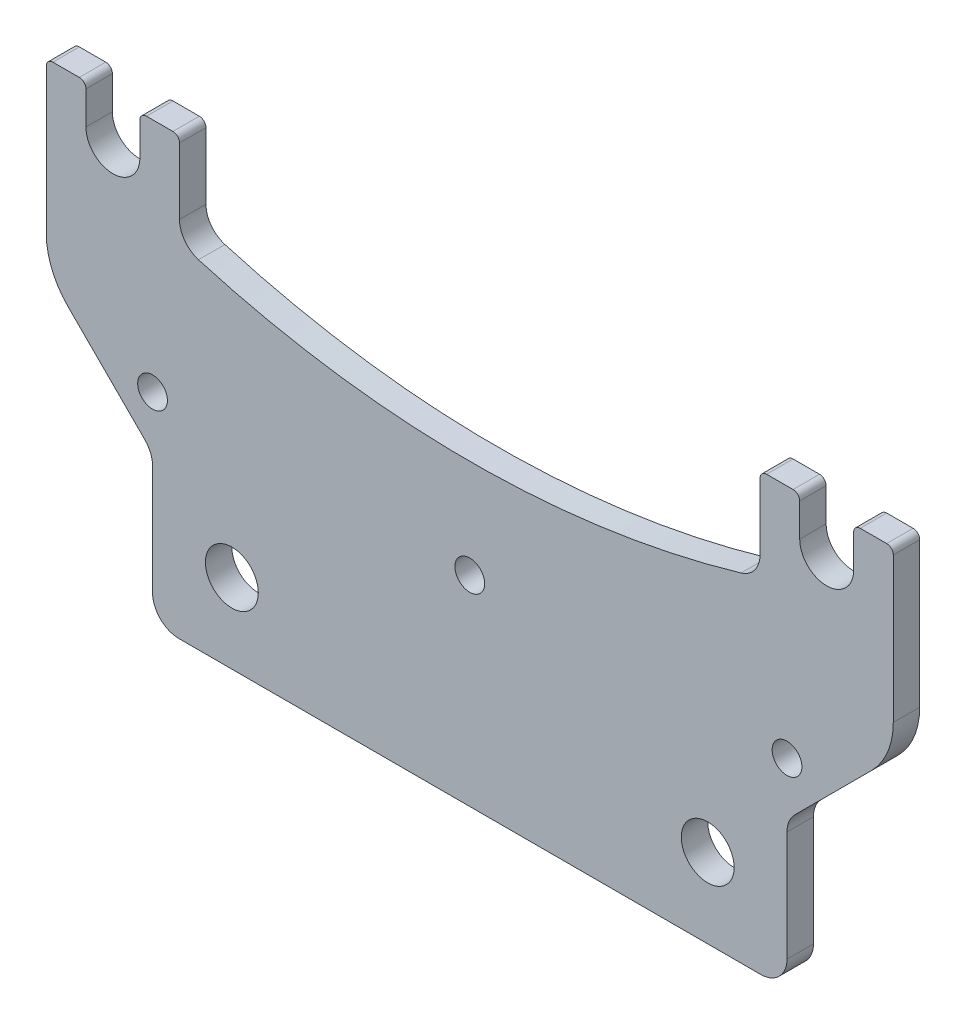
ISO-10303-21;
HEADER;
FILE_DESCRIPTION(('STEP AP214'),'2;1');
FILE_NAME('part.step','',(''),(''),'','','');
FILE_SCHEMA(('AUTOMOTIVE_DESIGN { 1 0 10303 214 1 1 1 1 }'));
ENDSEC;
DATA;
#1=APPLICATION_CONTEXT('core data for automotive mechanical design processes');
#2=APPLICATION_PROTOCOL_DEFINITION('international standard','automotive_design',2000,#1);
#3=PRODUCT_CONTEXT('',#1,'mechanical');
#4=PRODUCT('Part','Part','',(#3));
#5=PRODUCT_RELATED_PRODUCT_CATEGORY('part','',(#4));
#6=PRODUCT_DEFINITION_FORMATION('','',#4);
#7=PRODUCT_DEFINITION_CONTEXT('part definition',#1,'design');
#8=PRODUCT_DEFINITION('design','',#6,#7);
#9=PRODUCT_DEFINITION_SHAPE('','',#8);
#10=(LENGTH_UNIT() NAMED_UNIT(*) SI_UNIT(.MILLI.,.METRE.));
#11=(NAMED_UNIT(*) PLANE_ANGLE_UNIT() SI_UNIT($,.RADIAN.));
#12=(NAMED_UNIT(*) SI_UNIT($,.STERADIAN.) SOLID_ANGLE_UNIT());
#13=UNCERTAINTY_MEASURE_WITH_UNIT(LENGTH_MEASURE(1.E-05),#10,'distance_accuracy_value','');
#14=(GEOMETRIC_REPRESENTATION_CONTEXT(3) GLOBAL_UNCERTAINTY_ASSIGNED_CONTEXT((#13)) GLOBAL_UNIT_ASSIGNED_CONTEXT((#10,
#11,#12)) REPRESENTATION_CONTEXT('',''));
#15=CARTESIAN_POINT('',(0.,0.,0.));
#16=DIRECTION('',(0.,0.,1.));
#17=DIRECTION('',(1.,0.,0.));
#18=AXIS2_PLACEMENT_3D('',#15,#16,#17);
#19=CARTESIAN_POINT('',(85.725,207.94327164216,6.35));
#20=DIRECTION('',(0.,0.,1.));
#21=DIRECTION('',(1.,0.,0.));
#22=AXIS2_PLACEMENT_3D('',#19,#20,#21);
#23=PLANE('',#22);
#24=CARTESIAN_POINT('',(9.52499999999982,-47.1169999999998,6.35));
#25=DIRECTION('',(0.,0.,1.));
#26=DIRECTION('',(1.,0.,0.));
#27=AXIS2_PLACEMENT_3D('',#24,#25,#26);
#28=CIRCLE('',#27,3.57124);
#29=CARTESIAN_POINT('',(13.0962399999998,-47.1169999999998,6.35));
#30=VERTEX_POINT('',#29);
#31=EDGE_CURVE('E586',#30,#30,#28,.T.);
#32=ORIENTED_EDGE('',*,*,#31,.F.);
#33=EDGE_LOOP('',(#32));
#34=FACE_BOUND('',#33,.T.);
#35=CARTESIAN_POINT('',(85.725,-47.1169999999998,6.35));
#36=DIRECTION('',(0.,0.,1.));
#37=DIRECTION('',(1.,0.,0.));
#38=AXIS2_PLACEMENT_3D('',#35,#36,#37);
#39=CIRCLE('',#38,3.57124);
#40=CARTESIAN_POINT('',(89.29624,-47.1169999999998,6.35));
#41=VERTEX_POINT('',#40);
#42=EDGE_CURVE('E580',#41,#41,#39,.T.);
#43=ORIENTED_EDGE('',*,*,#42,.F.);
#44=EDGE_LOOP('',(#43));
#45=FACE_BOUND('',#44,.T.);
#46=CARTESIAN_POINT('',(161.925,-47.1169999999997,6.35));
#47=DIRECTION('',(0.,0.,1.));
#48=DIRECTION('',(1.,0.,0.));
#49=AXIS2_PLACEMENT_3D('',#46,#47,#48);
#50=CIRCLE('',#49,3.57124);
#51=CARTESIAN_POINT('',(165.49624,-47.1169999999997,6.35));
#52=VERTEX_POINT('',#51);
#53=EDGE_CURVE('E574',#52,#52,#50,.T.);
#54=ORIENTED_EDGE('',*,*,#53,.F.);
#55=EDGE_LOOP('',(#54));
#56=FACE_BOUND('',#55,.T.);
#57=DIRECTION('',(0.,1.,0.));
#58=VECTOR('',#57,1.);
#59=CARTESIAN_POINT('',(9.52499999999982,-95.25,6.35));
#60=LINE('',#59,#58);
#61=CARTESIAN_POINT('',(9.52499999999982,-88.9,6.35));
#62=VERTEX_POINT('',#61);
#63=CARTESIAN_POINT('',(9.5249999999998,-62.4472561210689,6.35));
#64=VERTEX_POINT('',#63);
#65=EDGE_CURVE('E555',#62,#64,#60,.T.);
#66=ORIENTED_EDGE('',*,*,#65,.F.);
#67=CARTESIAN_POINT('',(15.8749999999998,-88.9,6.35));
#68=DIRECTION('',(0.,0.,1.));
#69=DIRECTION('',(1.,0.,0.));
#70=AXIS2_PLACEMENT_3D('',#67,#68,#69);
#71=CIRCLE('',#70,6.35);
#72=CARTESIAN_POINT('',(15.8749999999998,-95.25,6.35));
#73=VERTEX_POINT('',#72);
#74=EDGE_CURVE('E480',#62,#73,#71,.T.);
#75=ORIENTED_EDGE('',*,*,#74,.T.);
#76=DIRECTION('',(1.,0.,0.));
#77=VECTOR('',#76,1.);
#78=CARTESIAN_POINT('',(9.52499999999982,-95.25,6.35));
#79=LINE('',#78,#77);
#80=CARTESIAN_POINT('',(155.575,-95.25,6.35));
#81=VERTEX_POINT('',#80);
#82=EDGE_CURVE('E305',#73,#81,#79,.T.);
#83=ORIENTED_EDGE('',*,*,#82,.T.);
#84=CARTESIAN_POINT('',(155.575,-88.9,6.35));
#85=DIRECTION('',(0.,0.,1.));
#86=DIRECTION('',(1.,0.,0.));
#87=AXIS2_PLACEMENT_3D('',#84,#85,#86);
#88=CIRCLE('',#87,6.35);
#89=CARTESIAN_POINT('',(161.925,-88.9,6.35));
#90=VERTEX_POINT('',#89);
#91=EDGE_CURVE('E55',#81,#90,#88,.T.);
#92=ORIENTED_EDGE('',*,*,#91,.T.);
#93=DIRECTION('',(0.,-1.,0.));
#94=VECTOR('',#93,1.);
#95=CARTESIAN_POINT('',(161.925,-95.2499999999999,6.35));
#96=LINE('',#95,#94);
#97=CARTESIAN_POINT('',(161.925,-62.4472561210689,6.35));
#98=VERTEX_POINT('',#97);
#99=EDGE_CURVE('E562',#98,#90,#96,.T.);
#100=ORIENTED_EDGE('',*,*,#99,.F.);
#101=CARTESIAN_POINT('',(168.275,-62.447256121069,6.35));
#102=DIRECTION('',(0.,0.,1.));
#103=DIRECTION('',(1.,0.,0.));
#104=AXIS2_PLACEMENT_3D('',#101,#102,#103);
#105=CIRCLE('',#104,6.35);
#106=CARTESIAN_POINT('',(163.784871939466,-57.9571280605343,6.35));
#107=VERTEX_POINT('',#106);
#108=EDGE_CURVE('E49',#98,#107,#105,.F.);
#109=ORIENTED_EDGE('',*,*,#108,.T.);
#110=DIRECTION('',(-0.707106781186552,-0.707106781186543,0.));
#111=VECTOR('',#110,1.);
#112=CARTESIAN_POINT('',(161.925,-59.8169999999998,6.35));
#113=LINE('',#112,#111);
#114=CARTESIAN_POINT('',(182.226198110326,-39.5158018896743,6.35));
#115=VERTEX_POINT('',#114);
#116=EDGE_CURVE('E565',#115,#107,#113,.T.);
#117=ORIENTED_EDGE('',*,*,#116,.F.);
#118=CARTESIAN_POINT('',(169.609996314,-26.8996000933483,6.35));
#119=DIRECTION('',(0.,0.,1.));
#120=DIRECTION('',(1.,0.,0.));
#121=AXIS2_PLACEMENT_3D('',#118,#119,#120);
#122=CIRCLE('',#121,17.842003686);
#123=CARTESIAN_POINT('',(187.452,-26.8996000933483,6.35));
#124=VERTEX_POINT('',#123);
#125=EDGE_CURVE('E379',#115,#124,#122,.T.);
#126=ORIENTED_EDGE('',*,*,#125,.T.);
#127=DIRECTION('',(0.,1.,0.));
#128=VECTOR('',#127,1.);
#129=CARTESIAN_POINT('',(187.452,4.7625,6.35));
#130=LINE('',#129,#128);
#131=CARTESIAN_POINT('',(187.452,7.93749999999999,6.35));
#132=VERTEX_POINT('',#131);
#133=EDGE_CURVE('E307',#124,#132,#130,.T.);
#134=ORIENTED_EDGE('',*,*,#133,.T.);
#135=CARTESIAN_POINT('',(185.8645,7.93749999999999,6.35));
#136=DIRECTION('',(0.,0.,1.));
#137=DIRECTION('',(1.,0.,0.));
#138=AXIS2_PLACEMENT_3D('',#135,#136,#137);
#139=CIRCLE('',#138,1.5875);
#140=CARTESIAN_POINT('',(185.8645,9.52499999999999,6.35));
#141=VERTEX_POINT('',#140);
#142=EDGE_CURVE('E431',#132,#141,#139,.T.);
#143=ORIENTED_EDGE('',*,*,#142,.T.);
#144=DIRECTION('',(-1.,0.,0.));
#145=VECTOR('',#144,1.);
#146=CARTESIAN_POINT('',(177.927,9.52499999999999,6.35));
#147=LINE('',#146,#145);
#148=CARTESIAN_POINT('',(179.5145,9.52499999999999,6.35));
#149=VERTEX_POINT('',#148);
#150=EDGE_CURVE('E310',#141,#149,#147,.T.);
#151=ORIENTED_EDGE('',*,*,#150,.T.);
#152=CARTESIAN_POINT('',(179.5145,7.93749999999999,6.35));
#153=DIRECTION('',(0.,0.,1.));
#154=DIRECTION('',(1.,0.,0.));
#155=AXIS2_PLACEMENT_3D('',#152,#153,#154);
#156=CIRCLE('',#155,1.5875);
#157=CARTESIAN_POINT('',(177.927,7.9375,6.35));
#158=VERTEX_POINT('',#157);
#159=EDGE_CURVE('E429',#149,#158,#156,.T.);
#160=ORIENTED_EDGE('',*,*,#159,.T.);
#161=DIRECTION('',(0.,-1.,0.));
#162=VECTOR('',#161,1.);
#163=CARTESIAN_POINT('',(177.927,4.7625,6.35));
#164=LINE('',#163,#162);
#165=CARTESIAN_POINT('',(177.927,0.,6.35));
#166=VERTEX_POINT('',#165);
#167=EDGE_CURVE('E313',#158,#166,#164,.T.);
#168=ORIENTED_EDGE('',*,*,#167,.T.);
#169=CARTESIAN_POINT('',(171.45,0.,6.35));
#170=DIRECTION('',(0.,0.,-1.));
#171=DIRECTION('',(-1.,0.,0.));
#172=AXIS2_PLACEMENT_3D('',#169,#170,#171);
#173=CIRCLE('',#172,6.47699999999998);
#174=CARTESIAN_POINT('',(164.973,0.,6.35));
#175=VERTEX_POINT('',#174);
#176=EDGE_CURVE('E315',#166,#175,#173,.T.);
#177=ORIENTED_EDGE('',*,*,#176,.T.);
#178=DIRECTION('',(0.,1.,0.));
#179=VECTOR('',#178,1.);
#180=CARTESIAN_POINT('',(164.973,0.,6.35));
#181=LINE('',#180,#179);
#182=CARTESIAN_POINT('',(164.973,7.93749999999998,6.35));
#183=VERTEX_POINT('',#182);
#184=EDGE_CURVE('E317',#175,#183,#181,.T.);
#185=ORIENTED_EDGE('',*,*,#184,.T.);
#186=CARTESIAN_POINT('',(163.3855,7.93749999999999,6.35));
#187=DIRECTION('',(0.,0.,1.));
#188=DIRECTION('',(1.,0.,0.));
#189=AXIS2_PLACEMENT_3D('',#186,#187,#188);
#190=CIRCLE('',#189,1.5875);
#191=CARTESIAN_POINT('',(163.3855,9.52499999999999,6.35));
#192=VERTEX_POINT('',#191);
#193=EDGE_CURVE('E427',#183,#192,#190,.T.);
#194=ORIENTED_EDGE('',*,*,#193,.T.);
#195=DIRECTION('',(-1.,0.,0.));
#196=VECTOR('',#195,1.);
#197=CARTESIAN_POINT('',(164.973,9.52499999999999,6.35));
#198=LINE('',#197,#196);
#199=CARTESIAN_POINT('',(157.0355,9.52499999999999,6.35));
#200=VERTEX_POINT('',#199);
#201=EDGE_CURVE('E320',#192,#200,#198,.T.);
#202=ORIENTED_EDGE('',*,*,#201,.T.);
#203=CARTESIAN_POINT('',(157.0355,7.93749999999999,6.35));
#204=DIRECTION('',(0.,0.,1.));
#205=DIRECTION('',(1.,0.,0.));
#206=AXIS2_PLACEMENT_3D('',#203,#204,#205);
#207=CIRCLE('',#206,1.5875);
#208=CARTESIAN_POINT('',(155.448,7.93749999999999,6.35));
#209=VERTEX_POINT('',#208);
#210=EDGE_CURVE('E425',#200,#209,#207,.T.);
#211=ORIENTED_EDGE('',*,*,#210,.T.);
#212=DIRECTION('',(0.,-1.,0.));
#213=VECTOR('',#212,1.);
#214=CARTESIAN_POINT('',(155.448,4.76249999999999,6.35));
#215=LINE('',#214,#213);
#216=CARTESIAN_POINT('',(155.448,-7.99697153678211,6.35));
#217=VERTEX_POINT('',#216);
#218=EDGE_CURVE('E367',#209,#217,#215,.T.);
#219=ORIENTED_EDGE('',*,*,#218,.T.);
#220=CARTESIAN_POINT('',(149.098,-7.99697153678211,6.35));
#221=DIRECTION('',(0.,0.,1.));
#222=DIRECTION('',(1.,0.,0.));
#223=AXIS2_PLACEMENT_3D('',#220,#221,#222);
#224=CIRCLE('',#223,6.35);
#225=CARTESIAN_POINT('',(150.886150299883,-14.0900018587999,6.35));
#226=VERTEX_POINT('',#225);
#227=EDGE_CURVE('E512',#217,#226,#224,.F.);
#228=ORIENTED_EDGE('',*,*,#227,.T.);
#229=CARTESIAN_POINT('',(85.725,207.94327164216,6.35));
#230=DIRECTION('',(0.,0.,-1.));
#231=DIRECTION('',(1.,0.,0.));
#232=AXIS2_PLACEMENT_3D('',#229,#230,#231);
#233=CIRCLE('',#232,231.397385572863);
#234=CARTESIAN_POINT('',(20.5638497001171,-14.0900018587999,6.35));
#235=VERTEX_POINT('',#234);
#236=EDGE_CURVE('E530',#226,#235,#233,.T.);
#237=ORIENTED_EDGE('',*,*,#236,.T.);
#238=CARTESIAN_POINT('',(22.352,-7.99697153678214,6.35));
#239=DIRECTION('',(0.,0.,1.));
#240=DIRECTION('',(1.,0.,0.));
#241=AXIS2_PLACEMENT_3D('',#238,#239,#240);
#242=CIRCLE('',#241,6.35);
#243=CARTESIAN_POINT('',(16.002,-7.99697153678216,6.35));
#244=VERTEX_POINT('',#243);
#245=EDGE_CURVE('E11',#235,#244,#242,.F.);
#246=ORIENTED_EDGE('',*,*,#245,.T.);
#247=DIRECTION('',(0.,1.,0.));
#248=VECTOR('',#247,1.);
#249=CARTESIAN_POINT('',(16.002,0.,6.35));
#250=LINE('',#249,#248);
#251=CARTESIAN_POINT('',(16.002,7.93749999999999,6.35));
#252=VERTEX_POINT('',#251);
#253=EDGE_CURVE('E529',#244,#252,#250,.T.);
#254=ORIENTED_EDGE('',*,*,#253,.T.);
#255=CARTESIAN_POINT('',(14.4145,7.93749999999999,6.35));
#256=DIRECTION('',(0.,0.,1.));
#257=DIRECTION('',(1.,0.,0.));
#258=AXIS2_PLACEMENT_3D('',#255,#256,#257);
#259=CIRCLE('',#258,1.5875);
#260=CARTESIAN_POINT('',(14.4145,9.52499999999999,6.35));
#261=VERTEX_POINT('',#260);
#262=EDGE_CURVE('E421',#252,#261,#259,.T.);
#263=ORIENTED_EDGE('',*,*,#262,.T.);
#264=DIRECTION('',(-1.,0.,0.));
#265=VECTOR('',#264,1.);
#266=CARTESIAN_POINT('',(6.47699999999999,9.52499999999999,6.35));
#267=LINE('',#266,#265);
#268=CARTESIAN_POINT('',(8.06449999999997,9.52499999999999,6.35));
#269=VERTEX_POINT('',#268);
#270=EDGE_CURVE('E279',#261,#269,#267,.T.);
#271=ORIENTED_EDGE('',*,*,#270,.T.);
#272=CARTESIAN_POINT('',(8.06449999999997,7.93749999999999,6.35));
#273=DIRECTION('',(0.,0.,1.));
#274=DIRECTION('',(1.,0.,0.));
#275=AXIS2_PLACEMENT_3D('',#272,#273,#274);
#276=CIRCLE('',#275,1.5875);
#277=CARTESIAN_POINT('',(6.47699999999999,7.93749999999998,6.35));
#278=VERTEX_POINT('',#277);
#279=EDGE_CURVE('E275',#269,#278,#276,.T.);
#280=ORIENTED_EDGE('',*,*,#279,.T.);
#281=DIRECTION('',(0.,-1.,0.));
#282=VECTOR('',#281,1.);
#283=CARTESIAN_POINT('',(6.47699999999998,4.7625,6.35));
#284=LINE('',#283,#282);
#285=CARTESIAN_POINT('',(6.477,0.,6.35));
#286=VERTEX_POINT('',#285);
#287=EDGE_CURVE('E265',#278,#286,#284,.T.);
#288=ORIENTED_EDGE('',*,*,#287,.T.);
#289=CARTESIAN_POINT('',(0.,0.,6.35));
#290=DIRECTION('',(0.,0.,-1.));
#291=DIRECTION('',(1.,0.,0.));
#292=AXIS2_PLACEMENT_3D('',#289,#290,#291);
#293=CIRCLE('',#292,6.477);
#294=CARTESIAN_POINT('',(-6.477,0.,6.35));
#295=VERTEX_POINT('',#294);
#296=EDGE_CURVE('E271',#286,#295,#293,.T.);
#297=ORIENTED_EDGE('',*,*,#296,.T.);
#298=DIRECTION('',(0.,1.,0.));
#299=VECTOR('',#298,1.);
#300=CARTESIAN_POINT('',(-6.477,0.,6.35));
#301=LINE('',#300,#299);
#302=CARTESIAN_POINT('',(-6.47699999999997,7.93749999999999,6.35));
#303=VERTEX_POINT('',#302);
#304=EDGE_CURVE('E295',#295,#303,#301,.T.);
#305=ORIENTED_EDGE('',*,*,#304,.T.);
#306=CARTESIAN_POINT('',(-8.0645,7.93749999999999,6.35));
#307=DIRECTION('',(0.,0.,1.));
#308=DIRECTION('',(1.,0.,0.));
#309=AXIS2_PLACEMENT_3D('',#306,#307,#308);
#310=CIRCLE('',#309,1.5875);
#311=CARTESIAN_POINT('',(-8.0645,9.52499999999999,6.35));
#312=VERTEX_POINT('',#311);
#313=EDGE_CURVE('E418',#303,#312,#310,.T.);
#314=ORIENTED_EDGE('',*,*,#313,.T.);
#315=DIRECTION('',(-1.,0.,0.));
#316=VECTOR('',#315,1.);
#317=CARTESIAN_POINT('',(-6.477,9.52499999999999,6.35));
#318=LINE('',#317,#316);
#319=CARTESIAN_POINT('',(-14.4145,9.52499999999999,6.35));
#320=VERTEX_POINT('',#319);
#321=EDGE_CURVE('E297',#312,#320,#318,.T.);
#322=ORIENTED_EDGE('',*,*,#321,.T.);
#323=CARTESIAN_POINT('',(-14.4145,7.93749999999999,6.35));
#324=DIRECTION('',(0.,0.,1.));
#325=DIRECTION('',(1.,0.,0.));
#326=AXIS2_PLACEMENT_3D('',#323,#324,#325);
#327=CIRCLE('',#326,1.5875);
#328=CARTESIAN_POINT('',(-16.002,7.93749999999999,6.35));
#329=VERTEX_POINT('',#328);
#330=EDGE_CURVE('E423',#320,#329,#327,.T.);
#331=ORIENTED_EDGE('',*,*,#330,.T.);
#332=DIRECTION('',(0.,-1.,0.));
#333=VECTOR('',#332,1.);
#334=CARTESIAN_POINT('',(-16.002,9.52499999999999,6.35));
#335=LINE('',#334,#333);
#336=CARTESIAN_POINT('',(-16.002,-26.899600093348,6.35));
#337=VERTEX_POINT('',#336);
#338=EDGE_CURVE('E303',#329,#337,#335,.T.);
#339=ORIENTED_EDGE('',*,*,#338,.T.);
#340=CARTESIAN_POINT('',(1.840003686,-26.899600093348,6.35));
#341=DIRECTION('',(0.,0.,1.));
#342=DIRECTION('',(1.,0.,0.));
#343=AXIS2_PLACEMENT_3D('',#340,#341,#342);
#344=CIRCLE('',#343,17.842003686);
#345=CARTESIAN_POINT('',(-10.776198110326,-39.515801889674,6.35));
#346=VERTEX_POINT('',#345);
#347=EDGE_CURVE('E376',#337,#346,#344,.T.);
#348=ORIENTED_EDGE('',*,*,#347,.T.);
#349=DIRECTION('',(-0.707106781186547,0.707106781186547,0.));
#350=VECTOR('',#349,1.);
#351=CARTESIAN_POINT('',(9.5249999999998,-59.8169999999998,6.35));
#352=LINE('',#351,#350);
#353=CARTESIAN_POINT('',(7.66512806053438,-57.9571280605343,6.35));
#354=VERTEX_POINT('',#353);
#355=EDGE_CURVE('E552',#354,#346,#352,.T.);
#356=ORIENTED_EDGE('',*,*,#355,.F.);
#357=CARTESIAN_POINT('',(3.1749999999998,-62.4472561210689,6.35));
#358=DIRECTION('',(0.,0.,1.));
#359=DIRECTION('',(1.,0.,0.));
#360=AXIS2_PLACEMENT_3D('',#357,#358,#359);
#361=CIRCLE('',#360,6.35);
#362=EDGE_CURVE('E503',#354,#64,#361,.F.);
#363=ORIENTED_EDGE('',*,*,#362,.T.);
#364=EDGE_LOOP('',(#66,#75,#83,#92,#100,#109,#117,#126,#134,#143,#151,#160,#168,#177,#185,#194,
#202,#211,#219,#228,#237,#246,#254,#263,#271,#280,#288,#297,#305,#314,#322,#331,#339,#348,#356,#363));
#365=FACE_BOUND('',#364,.T.);
#366=CARTESIAN_POINT('',(28.575,-76.2,6.35));
#367=DIRECTION('',(0.,0.,1.));
#368=DIRECTION('',(1.,0.,0.));
#369=AXIS2_PLACEMENT_3D('',#366,#367,#368);
#370=CIRCLE('',#369,6.35);
#371=CARTESIAN_POINT('',(34.925,-76.2,6.35));
#372=VERTEX_POINT('',#371);
#373=EDGE_CURVE('E328',#372,#372,#370,.T.);
#374=ORIENTED_EDGE('',*,*,#373,.F.);
#375=EDGE_LOOP('',(#374));
#376=FACE_BOUND('',#375,.T.);
#377=CARTESIAN_POINT('',(142.875,-76.2,6.35));
#378=DIRECTION('',(0.,0.,1.));
#379=DIRECTION('',(-1.,0.,0.));
#380=AXIS2_PLACEMENT_3D('',#377,#378,#379);
#381=CIRCLE('',#380,6.35000000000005);
#382=CARTESIAN_POINT('',(136.525,-76.2,6.35));
#383=VERTEX_POINT('',#382);
#384=EDGE_CURVE('E543',#383,#383,#381,.T.);
#385=ORIENTED_EDGE('',*,*,#384,.F.);
#386=EDGE_LOOP('',(#385));
#387=FACE_BOUND('',#386,.T.);
#388=ADVANCED_FACE('F34',(#34,#45,#56,#365,#376,#387),#23,.T.);
#389=CARTESIAN_POINT('',(85.725,207.94327164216,0.));
#390=DIRECTION('',(0.,0.,1.));
#391=DIRECTION('',(1.,0.,0.));
#392=AXIS2_PLACEMENT_3D('',#389,#390,#391);
#393=PLANE('',#392);
#394=CARTESIAN_POINT('',(9.52499999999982,-47.1169999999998,0.));
#395=DIRECTION('',(0.,0.,1.));
#396=DIRECTION('',(1.,0.,0.));
#397=AXIS2_PLACEMENT_3D('',#394,#395,#396);
#398=CIRCLE('',#397,3.57124);
#399=CARTESIAN_POINT('',(13.0962399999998,-47.1169999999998,0.));
#400=VERTEX_POINT('',#399);
#401=EDGE_CURVE('E583',#400,#400,#398,.T.);
#402=ORIENTED_EDGE('',*,*,#401,.T.);
#403=EDGE_LOOP('',(#402));
#404=FACE_BOUND('',#403,.T.);
#405=CARTESIAN_POINT('',(85.725,-47.1169999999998,0.));
#406=DIRECTION('',(0.,0.,1.));
#407=DIRECTION('',(1.,0.,0.));
#408=AXIS2_PLACEMENT_3D('',#405,#406,#407);
#409=CIRCLE('',#408,3.57124);
#410=CARTESIAN_POINT('',(89.29624,-47.1169999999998,0.));
#411=VERTEX_POINT('',#410);
#412=EDGE_CURVE('E577',#411,#411,#409,.T.);
#413=ORIENTED_EDGE('',*,*,#412,.T.);
#414=EDGE_LOOP('',(#413));
#415=FACE_BOUND('',#414,.T.);
#416=CARTESIAN_POINT('',(161.925,-47.1169999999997,0.));
#417=DIRECTION('',(0.,0.,1.));
#418=DIRECTION('',(1.,0.,0.));
#419=AXIS2_PLACEMENT_3D('',#416,#417,#418);
#420=CIRCLE('',#419,3.57124);
#421=CARTESIAN_POINT('',(165.49624,-47.1169999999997,0.));
#422=VERTEX_POINT('',#421);
#423=EDGE_CURVE('E567',#422,#422,#420,.T.);
#424=ORIENTED_EDGE('',*,*,#423,.T.);
#425=EDGE_LOOP('',(#424));
#426=FACE_BOUND('',#425,.T.);
#427=DIRECTION('',(1.,0.,0.));
#428=VECTOR('',#427,1.);
#429=CARTESIAN_POINT('',(9.52499999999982,-95.25,0.));
#430=LINE('',#429,#428);
#431=CARTESIAN_POINT('',(15.8749999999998,-95.25,0.));
#432=VERTEX_POINT('',#431);
#433=CARTESIAN_POINT('',(155.575,-95.25,0.));
#434=VERTEX_POINT('',#433);
#435=EDGE_CURVE('E344',#432,#434,#430,.T.);
#436=ORIENTED_EDGE('',*,*,#435,.F.);
#437=CARTESIAN_POINT('',(15.8749999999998,-88.9,0.));
#438=DIRECTION('',(0.,0.,1.));
#439=DIRECTION('',(1.,0.,0.));
#440=AXIS2_PLACEMENT_3D('',#437,#438,#439);
#441=CIRCLE('',#440,6.35);
#442=CARTESIAN_POINT('',(9.52499999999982,-88.9,0.));
#443=VERTEX_POINT('',#442);
#444=EDGE_CURVE('E473',#432,#443,#441,.F.);
#445=ORIENTED_EDGE('',*,*,#444,.T.);
#446=DIRECTION('',(0.,1.,0.));
#447=VECTOR('',#446,1.);
#448=CARTESIAN_POINT('',(9.52499999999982,-95.25,0.));
#449=LINE('',#448,#447);
#450=CARTESIAN_POINT('',(9.5249999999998,-62.4472561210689,0.));
#451=VERTEX_POINT('',#450);
#452=EDGE_CURVE('E554',#443,#451,#449,.T.);
#453=ORIENTED_EDGE('',*,*,#452,.T.);
#454=CARTESIAN_POINT('',(3.1749999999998,-62.4472561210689,0.));
#455=DIRECTION('',(0.,0.,1.));
#456=DIRECTION('',(1.,0.,0.));
#457=AXIS2_PLACEMENT_3D('',#454,#455,#456);
#458=CIRCLE('',#457,6.35);
#459=CARTESIAN_POINT('',(7.66512806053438,-57.9571280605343,0.));
#460=VERTEX_POINT('',#459);
#461=EDGE_CURVE('E505',#451,#460,#458,.T.);
#462=ORIENTED_EDGE('',*,*,#461,.T.);
#463=DIRECTION('',(-0.707106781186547,0.707106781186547,0.));
#464=VECTOR('',#463,1.);
#465=CARTESIAN_POINT('',(9.5249999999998,-59.8169999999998,0.));
#466=LINE('',#465,#464);
#467=CARTESIAN_POINT('',(-10.776198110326,-39.515801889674,0.));
#468=VERTEX_POINT('',#467);
#469=EDGE_CURVE('E549',#460,#468,#466,.T.);
#470=ORIENTED_EDGE('',*,*,#469,.T.);
#471=CARTESIAN_POINT('',(1.840003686,-26.899600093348,0.));
#472=DIRECTION('',(0.,0.,1.));
#473=DIRECTION('',(1.,0.,0.));
#474=AXIS2_PLACEMENT_3D('',#471,#472,#473);
#475=CIRCLE('',#474,17.842003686);
#476=CARTESIAN_POINT('',(-16.002,-26.899600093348,0.));
#477=VERTEX_POINT('',#476);
#478=EDGE_CURVE('E383',#468,#477,#475,.F.);
#479=ORIENTED_EDGE('',*,*,#478,.T.);
#480=DIRECTION('',(0.,-1.,0.));
#481=VECTOR('',#480,1.);
#482=CARTESIAN_POINT('',(-16.002,4.7625,0.));
#483=LINE('',#482,#481);
#484=CARTESIAN_POINT('',(-16.002,7.93749999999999,0.));
#485=VERTEX_POINT('',#484);
#486=EDGE_CURVE('E342',#485,#477,#483,.T.);
#487=ORIENTED_EDGE('',*,*,#486,.F.);
#488=CARTESIAN_POINT('',(-14.4145,7.93749999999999,0.));
#489=DIRECTION('',(0.,0.,1.));
#490=DIRECTION('',(1.,0.,0.));
#491=AXIS2_PLACEMENT_3D('',#488,#489,#490);
#492=CIRCLE('',#491,1.5875);
#493=CARTESIAN_POINT('',(-14.4145,9.52499999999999,0.));
#494=VERTEX_POINT('',#493);
#495=EDGE_CURVE('E406',#485,#494,#492,.F.);
#496=ORIENTED_EDGE('',*,*,#495,.T.);
#497=DIRECTION('',(-1.,0.,0.));
#498=VECTOR('',#497,1.);
#499=CARTESIAN_POINT('',(-6.477,9.52499999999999,0.));
#500=LINE('',#499,#498);
#501=CARTESIAN_POINT('',(-8.0645,9.52499999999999,0.));
#502=VERTEX_POINT('',#501);
#503=EDGE_CURVE('E339',#502,#494,#500,.T.);
#504=ORIENTED_EDGE('',*,*,#503,.F.);
#505=CARTESIAN_POINT('',(-8.0645,7.93749999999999,0.));
#506=DIRECTION('',(0.,0.,1.));
#507=DIRECTION('',(1.,0.,0.));
#508=AXIS2_PLACEMENT_3D('',#505,#506,#507);
#509=CIRCLE('',#508,1.5875);
#510=CARTESIAN_POINT('',(-6.47699999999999,7.9375,0.));
#511=VERTEX_POINT('',#510);
#512=EDGE_CURVE('E399',#502,#511,#509,.F.);
#513=ORIENTED_EDGE('',*,*,#512,.T.);
#514=DIRECTION('',(0.,1.,0.));
#515=VECTOR('',#514,1.);
#516=CARTESIAN_POINT('',(-6.47699999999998,4.7625,0.));
#517=LINE('',#516,#515);
#518=CARTESIAN_POINT('',(-6.477,0.,0.));
#519=VERTEX_POINT('',#518);
#520=EDGE_CURVE('E336',#519,#511,#517,.T.);
#521=ORIENTED_EDGE('',*,*,#520,.F.);
#522=CARTESIAN_POINT('',(0.,0.,0.));
#523=DIRECTION('',(0.,0.,-1.));
#524=DIRECTION('',(1.,0.,0.));
#525=AXIS2_PLACEMENT_3D('',#522,#523,#524);
#526=CIRCLE('',#525,6.477);
#527=CARTESIAN_POINT('',(6.477,0.,0.));
#528=VERTEX_POINT('',#527);
#529=EDGE_CURVE('E334',#528,#519,#526,.T.);
#530=ORIENTED_EDGE('',*,*,#529,.F.);
#531=DIRECTION('',(0.,-1.,0.));
#532=VECTOR('',#531,1.);
#533=CARTESIAN_POINT('',(6.477,0.,0.));
#534=LINE('',#533,#532);
#535=CARTESIAN_POINT('',(6.47699999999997,7.93749999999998,0.));
#536=VERTEX_POINT('',#535);
#537=EDGE_CURVE('E285',#536,#528,#534,.T.);
#538=ORIENTED_EDGE('',*,*,#537,.F.);
#539=CARTESIAN_POINT('',(8.06449999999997,7.93749999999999,0.));
#540=DIRECTION('',(0.,0.,1.));
#541=DIRECTION('',(1.,0.,0.));
#542=AXIS2_PLACEMENT_3D('',#539,#540,#541);
#543=CIRCLE('',#542,1.5875);
#544=CARTESIAN_POINT('',(8.06449999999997,9.52499999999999,0.));
#545=VERTEX_POINT('',#544);
#546=EDGE_CURVE('E401',#536,#545,#543,.F.);
#547=ORIENTED_EDGE('',*,*,#546,.T.);
#548=DIRECTION('',(-1.,0.,0.));
#549=VECTOR('',#548,1.);
#550=CARTESIAN_POINT('',(6.47699999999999,9.52499999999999,0.));
#551=LINE('',#550,#549);
#552=CARTESIAN_POINT('',(14.4145,9.52499999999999,0.));
#553=VERTEX_POINT('',#552);
#554=EDGE_CURVE('E330',#553,#545,#551,.T.);
#555=ORIENTED_EDGE('',*,*,#554,.F.);
#556=CARTESIAN_POINT('',(14.4145,7.93749999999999,0.));
#557=DIRECTION('',(0.,0.,1.));
#558=DIRECTION('',(1.,0.,0.));
#559=AXIS2_PLACEMENT_3D('',#556,#557,#558);
#560=CIRCLE('',#559,1.5875);
#561=CARTESIAN_POINT('',(16.002,7.93749999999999,0.));
#562=VERTEX_POINT('',#561);
#563=EDGE_CURVE('E403',#553,#562,#560,.F.);
#564=ORIENTED_EDGE('',*,*,#563,.T.);
#565=DIRECTION('',(0.,1.,0.));
#566=VECTOR('',#565,1.);
#567=CARTESIAN_POINT('',(16.002,9.52499999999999,0.));
#568=LINE('',#567,#566);
#569=CARTESIAN_POINT('',(16.0020000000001,-7.99697153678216,0.));
#570=VERTEX_POINT('',#569);
#571=EDGE_CURVE('E327',#570,#562,#568,.T.);
#572=ORIENTED_EDGE('',*,*,#571,.F.);
#573=CARTESIAN_POINT('',(22.352,-7.99697153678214,0.));
#574=DIRECTION('',(0.,0.,1.));
#575=DIRECTION('',(1.,0.,0.));
#576=AXIS2_PLACEMENT_3D('',#573,#574,#575);
#577=CIRCLE('',#576,6.35);
#578=CARTESIAN_POINT('',(20.5638497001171,-14.0900018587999,0.));
#579=VERTEX_POINT('',#578);
#580=EDGE_CURVE('E42',#570,#579,#577,.T.);
#581=ORIENTED_EDGE('',*,*,#580,.T.);
#582=CARTESIAN_POINT('',(85.725,207.94327164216,0.));
#583=DIRECTION('',(0.,0.,-1.));
#584=DIRECTION('',(1.,0.,0.));
#585=AXIS2_PLACEMENT_3D('',#582,#583,#584);
#586=CIRCLE('',#585,231.397385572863);
#587=CARTESIAN_POINT('',(150.886150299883,-14.0900018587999,0.));
#588=VERTEX_POINT('',#587);
#589=EDGE_CURVE('E324',#588,#579,#586,.T.);
#590=ORIENTED_EDGE('',*,*,#589,.F.);
#591=CARTESIAN_POINT('',(149.098,-7.99697153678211,0.));
#592=DIRECTION('',(0.,0.,1.));
#593=DIRECTION('',(1.,0.,0.));
#594=AXIS2_PLACEMENT_3D('',#591,#592,#593);
#595=CIRCLE('',#594,6.35);
#596=CARTESIAN_POINT('',(155.448,-7.99697153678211,0.));
#597=VERTEX_POINT('',#596);
#598=EDGE_CURVE('E510',#588,#597,#595,.T.);
#599=ORIENTED_EDGE('',*,*,#598,.T.);
#600=DIRECTION('',(0.,-1.,0.));
#601=VECTOR('',#600,1.);
#602=CARTESIAN_POINT('',(155.448,9.52499999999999,0.));
#603=LINE('',#602,#601);
#604=CARTESIAN_POINT('',(155.448,7.93749999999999,0.));
#605=VERTEX_POINT('',#604);
#606=EDGE_CURVE('E364',#605,#597,#603,.T.);
#607=ORIENTED_EDGE('',*,*,#606,.F.);
#608=CARTESIAN_POINT('',(157.0355,7.93749999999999,0.));
#609=DIRECTION('',(0.,0.,1.));
#610=DIRECTION('',(1.,0.,0.));
#611=AXIS2_PLACEMENT_3D('',#608,#609,#610);
#612=CIRCLE('',#611,1.5875);
#613=CARTESIAN_POINT('',(157.0355,9.52499999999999,0.));
#614=VERTEX_POINT('',#613);
#615=EDGE_CURVE('E408',#605,#614,#612,.F.);
#616=ORIENTED_EDGE('',*,*,#615,.T.);
#617=DIRECTION('',(-1.,0.,0.));
#618=VECTOR('',#617,1.);
#619=CARTESIAN_POINT('',(164.973,9.52499999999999,0.));
#620=LINE('',#619,#618);
#621=CARTESIAN_POINT('',(163.3855,9.52499999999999,0.));
#622=VERTEX_POINT('',#621);
#623=EDGE_CURVE('E361',#622,#614,#620,.T.);
#624=ORIENTED_EDGE('',*,*,#623,.F.);
#625=CARTESIAN_POINT('',(163.3855,7.93749999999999,0.));
#626=DIRECTION('',(0.,0.,1.));
#627=DIRECTION('',(1.,0.,0.));
#628=AXIS2_PLACEMENT_3D('',#625,#626,#627);
#629=CIRCLE('',#628,1.5875);
#630=CARTESIAN_POINT('',(164.973,7.93749999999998,0.));
#631=VERTEX_POINT('',#630);
#632=EDGE_CURVE('E410',#622,#631,#629,.F.);
#633=ORIENTED_EDGE('',*,*,#632,.T.);
#634=DIRECTION('',(0.,1.,0.));
#635=VECTOR('',#634,1.);
#636=CARTESIAN_POINT('',(164.973,4.76249999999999,0.));
#637=LINE('',#636,#635);
#638=CARTESIAN_POINT('',(164.973,0.,0.));
#639=VERTEX_POINT('',#638);
#640=EDGE_CURVE('E358',#639,#631,#637,.T.);
#641=ORIENTED_EDGE('',*,*,#640,.F.);
#642=CARTESIAN_POINT('',(171.45,0.,0.));
#643=DIRECTION('',(0.,0.,-1.));
#644=DIRECTION('',(-1.,0.,0.));
#645=AXIS2_PLACEMENT_3D('',#642,#643,#644);
#646=CIRCLE('',#645,6.47699999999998);
#647=CARTESIAN_POINT('',(177.927,0.,0.));
#648=VERTEX_POINT('',#647);
#649=EDGE_CURVE('E355',#648,#639,#646,.T.);
#650=ORIENTED_EDGE('',*,*,#649,.F.);
#651=DIRECTION('',(0.,-1.,0.));
#652=VECTOR('',#651,1.);
#653=CARTESIAN_POINT('',(177.927,0.,0.));
#654=LINE('',#653,#652);
#655=CARTESIAN_POINT('',(177.927,7.9375,0.));
#656=VERTEX_POINT('',#655);
#657=EDGE_CURVE('E353',#656,#648,#654,.T.);
#658=ORIENTED_EDGE('',*,*,#657,.F.);
#659=CARTESIAN_POINT('',(179.5145,7.93749999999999,0.));
#660=DIRECTION('',(0.,0.,1.));
#661=DIRECTION('',(1.,0.,0.));
#662=AXIS2_PLACEMENT_3D('',#659,#660,#661);
#663=CIRCLE('',#662,1.5875);
#664=CARTESIAN_POINT('',(179.5145,9.52499999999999,0.));
#665=VERTEX_POINT('',#664);
#666=EDGE_CURVE('E412',#656,#665,#663,.F.);
#667=ORIENTED_EDGE('',*,*,#666,.T.);
#668=DIRECTION('',(-1.,0.,0.));
#669=VECTOR('',#668,1.);
#670=CARTESIAN_POINT('',(177.927,9.52499999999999,0.));
#671=LINE('',#670,#669);
#672=CARTESIAN_POINT('',(185.8645,9.52499999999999,0.));
#673=VERTEX_POINT('',#672);
#674=EDGE_CURVE('E350',#673,#665,#671,.T.);
#675=ORIENTED_EDGE('',*,*,#674,.F.);
#676=CARTESIAN_POINT('',(185.8645,7.93749999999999,0.));
#677=DIRECTION('',(0.,0.,1.));
#678=DIRECTION('',(1.,0.,0.));
#679=AXIS2_PLACEMENT_3D('',#676,#677,#678);
#680=CIRCLE('',#679,1.5875);
#681=CARTESIAN_POINT('',(187.452,7.93749999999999,0.));
#682=VERTEX_POINT('',#681);
#683=EDGE_CURVE('E414',#673,#682,#680,.F.);
#684=ORIENTED_EDGE('',*,*,#683,.T.);
#685=DIRECTION('',(0.,1.,0.));
#686=VECTOR('',#685,1.);
#687=CARTESIAN_POINT('',(187.452,9.52499999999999,0.));
#688=LINE('',#687,#686);
#689=CARTESIAN_POINT('',(187.452,-26.8996000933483,0.));
#690=VERTEX_POINT('',#689);
#691=EDGE_CURVE('E347',#690,#682,#688,.T.);
#692=ORIENTED_EDGE('',*,*,#691,.F.);
#693=CARTESIAN_POINT('',(169.609996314,-26.8996000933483,0.));
#694=DIRECTION('',(0.,0.,1.));
#695=DIRECTION('',(1.,0.,0.));
#696=AXIS2_PLACEMENT_3D('',#693,#694,#695);
#697=CIRCLE('',#696,17.842003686);
#698=CARTESIAN_POINT('',(182.226198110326,-39.5158018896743,0.));
#699=VERTEX_POINT('',#698);
#700=EDGE_CURVE('E386',#690,#699,#697,.F.);
#701=ORIENTED_EDGE('',*,*,#700,.T.);
#702=DIRECTION('',(-0.707106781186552,-0.707106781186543,0.));
#703=VECTOR('',#702,1.);
#704=CARTESIAN_POINT('',(161.925,-59.8169999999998,0.));
#705=LINE('',#704,#703);
#706=CARTESIAN_POINT('',(163.784871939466,-57.9571280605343,0.));
#707=VERTEX_POINT('',#706);
#708=EDGE_CURVE('E564',#699,#707,#705,.T.);
#709=ORIENTED_EDGE('',*,*,#708,.T.);
#710=CARTESIAN_POINT('',(168.275,-62.447256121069,0.));
#711=DIRECTION('',(0.,0.,1.));
#712=DIRECTION('',(1.,0.,0.));
#713=AXIS2_PLACEMENT_3D('',#710,#711,#712);
#714=CIRCLE('',#713,6.35);
#715=CARTESIAN_POINT('',(161.925,-62.4472561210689,0.));
#716=VERTEX_POINT('',#715);
#717=EDGE_CURVE('E508',#707,#716,#714,.T.);
#718=ORIENTED_EDGE('',*,*,#717,.T.);
#719=DIRECTION('',(0.,-1.,0.));
#720=VECTOR('',#719,1.);
#721=CARTESIAN_POINT('',(161.925,-95.2499999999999,0.));
#722=LINE('',#721,#720);
#723=CARTESIAN_POINT('',(161.925,-88.9,0.));
#724=VERTEX_POINT('',#723);
#725=EDGE_CURVE('E558',#716,#724,#722,.T.);
#726=ORIENTED_EDGE('',*,*,#725,.T.);
#727=CARTESIAN_POINT('',(155.575,-88.9,0.));
#728=DIRECTION('',(0.,0.,1.));
#729=DIRECTION('',(1.,0.,0.));
#730=AXIS2_PLACEMENT_3D('',#727,#728,#729);
#731=CIRCLE('',#730,6.35);
#732=EDGE_CURVE('E471',#724,#434,#731,.F.);
#733=ORIENTED_EDGE('',*,*,#732,.T.);
#734=EDGE_LOOP('',(#436,#445,#453,#462,#470,#479,#487,#496,#504,#513,#521,#530,#538,#547,#555,
#564,#572,#581,#590,#599,#607,#616,#624,#633,#641,#650,#658,#667,#675,#684,#692,#701,#709,#718,
#726,#733));
#735=FACE_BOUND('',#734,.T.);
#736=CARTESIAN_POINT('',(28.575,-76.2,0.));
#737=DIRECTION('',(0.,0.,1.));
#738=DIRECTION('',(1.,0.,0.));
#739=AXIS2_PLACEMENT_3D('',#736,#737,#738);
#740=CIRCLE('',#739,6.35);
#741=CARTESIAN_POINT('',(34.925,-76.2,0.));
#742=VERTEX_POINT('',#741);
#743=EDGE_CURVE('E540',#742,#742,#740,.T.);
#744=ORIENTED_EDGE('',*,*,#743,.T.);
#745=EDGE_LOOP('',(#744));
#746=FACE_BOUND('',#745,.T.);
#747=CARTESIAN_POINT('',(142.875,-76.2,0.));
#748=DIRECTION('',(0.,0.,1.));
#749=DIRECTION('',(-1.,0.,0.));
#750=AXIS2_PLACEMENT_3D('',#747,#748,#749);
#751=CIRCLE('',#750,6.35000000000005);
#752=CARTESIAN_POINT('',(136.525,-76.2,0.));
#753=VERTEX_POINT('',#752);
#754=EDGE_CURVE('E546',#753,#753,#751,.T.);
#755=ORIENTED_EDGE('',*,*,#754,.T.);
#756=EDGE_LOOP('',(#755));
#757=FACE_BOUND('',#756,.T.);
#758=ADVANCED_FACE('F517',(#404,#415,#426,#735,#746,#757),#393,.F.);
#759=CARTESIAN_POINT('',(85.725,207.94327164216,6.35));
#760=DIRECTION('',(0.,0.,-1.));
#761=DIRECTION('',(-1.,0.,0.));
#762=AXIS2_PLACEMENT_3D('',#759,#760,#761);
#763=CYLINDRICAL_SURFACE('',#762,231.397385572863);
#764=ORIENTED_EDGE('',*,*,#236,.F.);
#765=DIRECTION('',(0.,0.,-1.));
#766=VECTOR('',#765,1.);
#767=CARTESIAN_POINT('',(150.886150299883,-14.0900018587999,6.35));
#768=LINE('',#767,#766);
#769=EDGE_CURVE('E495',#226,#588,#768,.T.);
#770=ORIENTED_EDGE('',*,*,#769,.T.);
#771=ORIENTED_EDGE('',*,*,#589,.T.);
#772=DIRECTION('',(0.,0.,-1.));
#773=VECTOR('',#772,1.);
#774=CARTESIAN_POINT('',(20.563849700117,-14.0900018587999,6.35));
#775=LINE('',#774,#773);
#776=EDGE_CURVE('E493',#579,#235,#775,.F.);
#777=ORIENTED_EDGE('',*,*,#776,.T.);
#778=EDGE_LOOP('',(#764,#770,#771,#777));
#779=FACE_BOUND('',#778,.T.);
#780=ADVANCED_FACE('F524',(#779),#763,.F.);
#781=CARTESIAN_POINT('',(16.002,9.52499999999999,6.35));
#782=DIRECTION('',(-1.,0.,0.));
#783=DIRECTION('',(0.,-1.,0.));
#784=AXIS2_PLACEMENT_3D('',#781,#782,#783);
#785=PLANE('',#784);
#786=ORIENTED_EDGE('',*,*,#253,.F.);
#787=DIRECTION('',(0.,0.,1.));
#788=VECTOR('',#787,1.);
#789=CARTESIAN_POINT('',(16.0020000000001,-7.99697153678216,0.));
#790=LINE('',#789,#788);
#791=EDGE_CURVE('E500',#244,#570,#790,.F.);
#792=ORIENTED_EDGE('',*,*,#791,.T.);
#793=ORIENTED_EDGE('',*,*,#571,.T.);
#794=DIRECTION('',(0.,0.,-1.));
#795=VECTOR('',#794,1.);
#796=CARTESIAN_POINT('',(16.002,7.93749999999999,6.35));
#797=LINE('',#796,#795);
#798=EDGE_CURVE('E459',#562,#252,#797,.F.);
#799=ORIENTED_EDGE('',*,*,#798,.T.);
#800=EDGE_LOOP('',(#786,#792,#793,#799));
#801=FACE_BOUND('',#800,.T.);
#802=ADVANCED_FACE('F532',(#801),#785,.F.);
#803=CARTESIAN_POINT('',(6.47699999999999,9.52499999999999,6.35));
#804=DIRECTION('',(0.,-1.,0.));
#805=DIRECTION('',(0.,0.,-1.));
#806=AXIS2_PLACEMENT_3D('',#803,#804,#805);
#807=PLANE('',#806);
#808=ORIENTED_EDGE('',*,*,#270,.F.);
#809=DIRECTION('',(0.,0.,-1.));
#810=VECTOR('',#809,1.);
#811=CARTESIAN_POINT('',(14.4145,9.52499999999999,6.35));
#812=LINE('',#811,#810);
#813=EDGE_CURVE('E456',#261,#553,#812,.T.);
#814=ORIENTED_EDGE('',*,*,#813,.T.);
#815=ORIENTED_EDGE('',*,*,#554,.T.);
#816=DIRECTION('',(0.,0.,-1.));
#817=VECTOR('',#816,1.);
#818=CARTESIAN_POINT('',(8.06449999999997,9.52499999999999,6.35));
#819=LINE('',#818,#817);
#820=EDGE_CURVE('E454',#545,#269,#819,.F.);
#821=ORIENTED_EDGE('',*,*,#820,.T.);
#822=EDGE_LOOP('',(#808,#814,#815,#821));
#823=FACE_BOUND('',#822,.T.);
#824=ADVANCED_FACE('F687',(#823),#807,.F.);
#825=CARTESIAN_POINT('',(6.477,0.,6.35));
#826=DIRECTION('',(1.,0.,0.));
#827=DIRECTION('',(0.,1.,0.));
#828=AXIS2_PLACEMENT_3D('',#825,#826,#827);
#829=PLANE('',#828);
#830=ORIENTED_EDGE('',*,*,#287,.F.);
#831=DIRECTION('',(0.,0.,-1.));
#832=VECTOR('',#831,1.);
#833=CARTESIAN_POINT('',(6.47699999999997,7.93749999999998,6.35));
#834=LINE('',#833,#832);
#835=EDGE_CURVE('E462',#278,#536,#834,.T.);
#836=ORIENTED_EDGE('',*,*,#835,.T.);
#837=ORIENTED_EDGE('',*,*,#537,.T.);
#838=DIRECTION('',(0.,0.,-1.));
#839=VECTOR('',#838,1.);
#840=CARTESIAN_POINT('',(6.477,0.,6.35));
#841=LINE('',#840,#839);
#842=EDGE_CURVE('E282',#286,#528,#841,.T.);
#843=ORIENTED_EDGE('',*,*,#842,.F.);
#844=EDGE_LOOP('',(#830,#836,#837,#843));
#845=FACE_BOUND('',#844,.T.);
#846=ADVANCED_FACE('F283',(#845),#829,.F.);
#847=CARTESIAN_POINT('',(0.,0.,6.35));
#848=DIRECTION('',(0.,0.,-1.));
#849=DIRECTION('',(-1.,0.,0.));
#850=AXIS2_PLACEMENT_3D('',#847,#848,#849);
#851=CYLINDRICAL_SURFACE('',#850,6.477);
#852=ORIENTED_EDGE('',*,*,#529,.T.);
#853=DIRECTION('',(0.,0.,-1.));
#854=VECTOR('',#853,1.);
#855=CARTESIAN_POINT('',(-6.477,0.,6.35));
#856=LINE('',#855,#854);
#857=EDGE_CURVE('E290',#295,#519,#856,.T.);
#858=ORIENTED_EDGE('',*,*,#857,.F.);
#859=ORIENTED_EDGE('',*,*,#296,.F.);
#860=ORIENTED_EDGE('',*,*,#842,.T.);
#861=EDGE_LOOP('',(#852,#858,#859,#860));
#862=FACE_BOUND('',#861,.T.);
#863=ADVANCED_FACE('F292',(#862),#851,.F.);
#864=CARTESIAN_POINT('',(-6.47699999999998,4.7625,6.35));
#865=DIRECTION('',(-1.,0.,0.));
#866=DIRECTION('',(0.,-1.,0.));
#867=AXIS2_PLACEMENT_3D('',#864,#865,#866);
#868=PLANE('',#867);
#869=ORIENTED_EDGE('',*,*,#520,.T.);
#870=DIRECTION('',(0.,0.,-1.));
#871=VECTOR('',#870,1.);
#872=CARTESIAN_POINT('',(-6.47699999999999,7.9375,6.35));
#873=LINE('',#872,#871);
#874=EDGE_CURVE('E464',#511,#303,#873,.F.);
#875=ORIENTED_EDGE('',*,*,#874,.T.);
#876=ORIENTED_EDGE('',*,*,#304,.F.);
#877=ORIENTED_EDGE('',*,*,#857,.T.);
#878=EDGE_LOOP('',(#869,#875,#876,#877));
#879=FACE_BOUND('',#878,.T.);
#880=ADVANCED_FACE('F678',(#879),#868,.F.);
#881=CARTESIAN_POINT('',(-6.477,9.52499999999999,6.35));
#882=DIRECTION('',(0.,-1.,0.));
#883=DIRECTION('',(1.,0.,0.));
#884=AXIS2_PLACEMENT_3D('',#881,#882,#883);
#885=PLANE('',#884);
#886=ORIENTED_EDGE('',*,*,#503,.T.);
#887=DIRECTION('',(0.,0.,-1.));
#888=VECTOR('',#887,1.);
#889=CARTESIAN_POINT('',(-14.4145,9.52499999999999,6.35));
#890=LINE('',#889,#888);
#891=EDGE_CURVE('E452',#494,#320,#890,.F.);
#892=ORIENTED_EDGE('',*,*,#891,.T.);
#893=ORIENTED_EDGE('',*,*,#321,.F.);
#894=DIRECTION('',(0.,0.,-1.));
#895=VECTOR('',#894,1.);
#896=CARTESIAN_POINT('',(-8.0645,9.52499999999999,6.35));
#897=LINE('',#896,#895);
#898=EDGE_CURVE('E449',#312,#502,#897,.T.);
#899=ORIENTED_EDGE('',*,*,#898,.T.);
#900=EDGE_LOOP('',(#886,#892,#893,#899));
#901=FACE_BOUND('',#900,.T.);
#902=ADVANCED_FACE('F674',(#901),#885,.F.);
#903=CARTESIAN_POINT('',(-16.002,4.7625,6.35));
#904=DIRECTION('',(1.,0.,0.));
#905=DIRECTION('',(0.,1.,0.));
#906=AXIS2_PLACEMENT_3D('',#903,#904,#905);
#907=PLANE('',#906);
#908=ORIENTED_EDGE('',*,*,#338,.F.);
#909=DIRECTION('',(0.,0.,-1.));
#910=VECTOR('',#909,1.);
#911=CARTESIAN_POINT('',(-16.002,7.93749999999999,6.35));
#912=LINE('',#911,#910);
#913=EDGE_CURVE('E446',#329,#485,#912,.T.);
#914=ORIENTED_EDGE('',*,*,#913,.T.);
#915=ORIENTED_EDGE('',*,*,#486,.T.);
#916=DIRECTION('',(0.,0.,1.));
#917=VECTOR('',#916,1.);
#918=CARTESIAN_POINT('',(-16.002,-26.899600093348,6.35));
#919=LINE('',#918,#917);
#920=EDGE_CURVE('E388',#477,#337,#919,.T.);
#921=ORIENTED_EDGE('',*,*,#920,.T.);
#922=EDGE_LOOP('',(#908,#914,#915,#921));
#923=FACE_BOUND('',#922,.T.);
#924=ADVANCED_FACE('F670',(#923),#907,.F.);
#925=CARTESIAN_POINT('',(9.52499999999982,-95.25,6.35));
#926=DIRECTION('',(0.,1.,0.));
#927=DIRECTION('',(-1.,0.,0.));
#928=AXIS2_PLACEMENT_3D('',#925,#926,#927);
#929=PLANE('',#928);
#930=ORIENTED_EDGE('',*,*,#82,.F.);
#931=DIRECTION('',(0.,0.,-1.));
#932=VECTOR('',#931,1.);
#933=CARTESIAN_POINT('',(15.8749999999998,-95.25,6.35));
#934=LINE('',#933,#932);
#935=EDGE_CURVE('E468',#73,#432,#934,.T.);
#936=ORIENTED_EDGE('',*,*,#935,.T.);
#937=ORIENTED_EDGE('',*,*,#435,.T.);
#938=DIRECTION('',(0.,0.,-1.));
#939=VECTOR('',#938,1.);
#940=CARTESIAN_POINT('',(155.575,-95.25,6.35));
#941=LINE('',#940,#939);
#942=EDGE_CURVE('E466',#434,#81,#941,.F.);
#943=ORIENTED_EDGE('',*,*,#942,.T.);
#944=EDGE_LOOP('',(#930,#936,#937,#943));
#945=FACE_BOUND('',#944,.T.);
#946=ADVANCED_FACE('F666',(#945),#929,.F.);
#947=CARTESIAN_POINT('',(187.452,9.52499999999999,6.35));
#948=DIRECTION('',(-1.,0.,0.));
#949=DIRECTION('',(0.,0.,1.));
#950=AXIS2_PLACEMENT_3D('',#947,#948,#949);
#951=PLANE('',#950);
#952=ORIENTED_EDGE('',*,*,#691,.T.);
#953=DIRECTION('',(0.,0.,-1.));
#954=VECTOR('',#953,1.);
#955=CARTESIAN_POINT('',(187.452,7.93749999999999,6.35));
#956=LINE('',#955,#954);
#957=EDGE_CURVE('E416',#682,#132,#956,.F.);
#958=ORIENTED_EDGE('',*,*,#957,.T.);
#959=ORIENTED_EDGE('',*,*,#133,.F.);
#960=DIRECTION('',(0.,0.,1.));
#961=VECTOR('',#960,1.);
#962=CARTESIAN_POINT('',(187.452,-26.8996000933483,6.35));
#963=LINE('',#962,#961);
#964=EDGE_CURVE('E381',#124,#690,#963,.F.);
#965=ORIENTED_EDGE('',*,*,#964,.T.);
#966=EDGE_LOOP('',(#952,#958,#959,#965));
#967=FACE_BOUND('',#966,.T.);
#968=ADVANCED_FACE('F662',(#967),#951,.F.);
#969=CARTESIAN_POINT('',(177.927,9.52499999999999,6.35));
#970=DIRECTION('',(0.,-1.,0.));
#971=DIRECTION('',(1.,0.,0.));
#972=AXIS2_PLACEMENT_3D('',#969,#970,#971);
#973=PLANE('',#972);
#974=ORIENTED_EDGE('',*,*,#150,.F.);
#975=DIRECTION('',(0.,0.,-1.));
#976=VECTOR('',#975,1.);
#977=CARTESIAN_POINT('',(185.8645,9.52499999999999,6.35));
#978=LINE('',#977,#976);
#979=EDGE_CURVE('E396',#141,#673,#978,.T.);
#980=ORIENTED_EDGE('',*,*,#979,.T.);
#981=ORIENTED_EDGE('',*,*,#674,.T.);
#982=DIRECTION('',(0.,0.,-1.));
#983=VECTOR('',#982,1.);
#984=CARTESIAN_POINT('',(179.5145,9.52499999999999,6.35));
#985=LINE('',#984,#983);
#986=EDGE_CURVE('E394',#665,#149,#985,.F.);
#987=ORIENTED_EDGE('',*,*,#986,.T.);
#988=EDGE_LOOP('',(#974,#980,#981,#987));
#989=FACE_BOUND('',#988,.T.);
#990=ADVANCED_FACE('F658',(#989),#973,.F.);
#991=CARTESIAN_POINT('',(177.927,0.,6.35));
#992=DIRECTION('',(1.,0.,0.));
#993=DIRECTION('',(0.,1.,0.));
#994=AXIS2_PLACEMENT_3D('',#991,#992,#993);
#995=PLANE('',#994);
#996=ORIENTED_EDGE('',*,*,#167,.F.);
#997=DIRECTION('',(0.,0.,-1.));
#998=VECTOR('',#997,1.);
#999=CARTESIAN_POINT('',(177.927,7.9375,6.35));
#1000=LINE('',#999,#998);
#1001=EDGE_CURVE('E433',#158,#656,#1000,.T.);
#1002=ORIENTED_EDGE('',*,*,#1001,.T.);
#1003=ORIENTED_EDGE('',*,*,#657,.T.);
#1004=DIRECTION('',(0.,0.,-1.));
#1005=VECTOR('',#1004,1.);
#1006=CARTESIAN_POINT('',(177.927,0.,6.35));
#1007=LINE('',#1006,#1005);
#1008=EDGE_CURVE('E370',#166,#648,#1007,.T.);
#1009=ORIENTED_EDGE('',*,*,#1008,.F.);
#1010=EDGE_LOOP('',(#996,#1002,#1003,#1009));
#1011=FACE_BOUND('',#1010,.T.);
#1012=ADVANCED_FACE('F654',(#1011),#995,.F.);
#1013=CARTESIAN_POINT('',(171.45,0.,6.35));
#1014=DIRECTION('',(0.,0.,-1.));
#1015=DIRECTION('',(-1.,0.,0.));
#1016=AXIS2_PLACEMENT_3D('',#1013,#1014,#1015);
#1017=CYLINDRICAL_SURFACE('',#1016,6.47699999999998);
#1018=ORIENTED_EDGE('',*,*,#649,.T.);
#1019=DIRECTION('',(0.,0.,-1.));
#1020=VECTOR('',#1019,1.);
#1021=CARTESIAN_POINT('',(164.973,0.,6.35));
#1022=LINE('',#1021,#1020);
#1023=EDGE_CURVE('E323',#175,#639,#1022,.T.);
#1024=ORIENTED_EDGE('',*,*,#1023,.F.);
#1025=ORIENTED_EDGE('',*,*,#176,.F.);
#1026=ORIENTED_EDGE('',*,*,#1008,.T.);
#1027=EDGE_LOOP('',(#1018,#1024,#1025,#1026));
#1028=FACE_BOUND('',#1027,.T.);
#1029=ADVANCED_FACE('F650',(#1028),#1017,.F.);
#1030=CARTESIAN_POINT('',(164.973,4.76249999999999,6.35));
#1031=DIRECTION('',(-1.,0.,0.));
#1032=DIRECTION('',(0.,-1.,0.));
#1033=AXIS2_PLACEMENT_3D('',#1030,#1031,#1032);
#1034=PLANE('',#1033);
#1035=ORIENTED_EDGE('',*,*,#640,.T.);
#1036=DIRECTION('',(0.,0.,-1.));
#1037=VECTOR('',#1036,1.);
#1038=CARTESIAN_POINT('',(164.973,7.93749999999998,6.35));
#1039=LINE('',#1038,#1037);
#1040=EDGE_CURVE('E441',#631,#183,#1039,.F.);
#1041=ORIENTED_EDGE('',*,*,#1040,.T.);
#1042=ORIENTED_EDGE('',*,*,#184,.F.);
#1043=ORIENTED_EDGE('',*,*,#1023,.T.);
#1044=EDGE_LOOP('',(#1035,#1041,#1042,#1043));
#1045=FACE_BOUND('',#1044,.T.);
#1046=ADVANCED_FACE('F646',(#1045),#1034,.F.);
#1047=CARTESIAN_POINT('',(164.973,9.52499999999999,6.35));
#1048=DIRECTION('',(0.,-1.,0.));
#1049=DIRECTION('',(0.,0.,-1.));
#1050=AXIS2_PLACEMENT_3D('',#1047,#1048,#1049);
#1051=PLANE('',#1050);
#1052=ORIENTED_EDGE('',*,*,#201,.F.);
#1053=DIRECTION('',(0.,0.,-1.));
#1054=VECTOR('',#1053,1.);
#1055=CARTESIAN_POINT('',(163.3855,9.52499999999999,6.35));
#1056=LINE('',#1055,#1054);
#1057=EDGE_CURVE('E438',#192,#622,#1056,.T.);
#1058=ORIENTED_EDGE('',*,*,#1057,.T.);
#1059=ORIENTED_EDGE('',*,*,#623,.T.);
#1060=DIRECTION('',(0.,0.,-1.));
#1061=VECTOR('',#1060,1.);
#1062=CARTESIAN_POINT('',(157.0355,9.52499999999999,6.35));
#1063=LINE('',#1062,#1061);
#1064=EDGE_CURVE('E436',#614,#200,#1063,.F.);
#1065=ORIENTED_EDGE('',*,*,#1064,.T.);
#1066=EDGE_LOOP('',(#1052,#1058,#1059,#1065));
#1067=FACE_BOUND('',#1066,.T.);
#1068=ADVANCED_FACE('F642',(#1067),#1051,.F.);
#1069=CARTESIAN_POINT('',(155.448,9.52499999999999,6.35));
#1070=DIRECTION('',(1.,0.,0.));
#1071=DIRECTION('',(0.,0.,-1.));
#1072=AXIS2_PLACEMENT_3D('',#1069,#1070,#1071);
#1073=PLANE('',#1072);
#1074=ORIENTED_EDGE('',*,*,#606,.T.);
#1075=DIRECTION('',(0.,0.,1.));
#1076=VECTOR('',#1075,1.);
#1077=CARTESIAN_POINT('',(155.448,-7.99697153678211,6.35));
#1078=LINE('',#1077,#1076);
#1079=EDGE_CURVE('E498',#597,#217,#1078,.T.);
#1080=ORIENTED_EDGE('',*,*,#1079,.T.);
#1081=ORIENTED_EDGE('',*,*,#218,.F.);
#1082=DIRECTION('',(0.,0.,-1.));
#1083=VECTOR('',#1082,1.);
#1084=CARTESIAN_POINT('',(155.448,7.93749999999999,6.35));
#1085=LINE('',#1084,#1083);
#1086=EDGE_CURVE('E443',#209,#605,#1085,.T.);
#1087=ORIENTED_EDGE('',*,*,#1086,.T.);
#1088=EDGE_LOOP('',(#1074,#1080,#1081,#1087));
#1089=FACE_BOUND('',#1088,.T.);
#1090=ADVANCED_FACE('F634',(#1089),#1073,.F.);
#1091=CARTESIAN_POINT('',(28.575,-76.2,6.35));
#1092=DIRECTION('',(0.,0.,-1.));
#1093=DIRECTION('',(-1.,0.,0.));
#1094=AXIS2_PLACEMENT_3D('',#1091,#1092,#1093);
#1095=CYLINDRICAL_SURFACE('',#1094,6.35);
#1096=ORIENTED_EDGE('',*,*,#373,.T.);
#1097=EDGE_LOOP('',(#1096));
#1098=FACE_BOUND('',#1097,.T.);
#1099=ORIENTED_EDGE('',*,*,#743,.F.);
#1100=EDGE_LOOP('',(#1099));
#1101=FACE_BOUND('',#1100,.T.);
#1102=ADVANCED_FACE('F631',(#1098,#1101),#1095,.F.);
#1103=CARTESIAN_POINT('',(142.875,-76.2,6.35));
#1104=DIRECTION('',(0.,0.,-1.));
#1105=DIRECTION('',(-1.,0.,0.));
#1106=AXIS2_PLACEMENT_3D('',#1103,#1104,#1105);
#1107=CYLINDRICAL_SURFACE('',#1106,6.35000000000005);
#1108=ORIENTED_EDGE('',*,*,#384,.T.);
#1109=EDGE_LOOP('',(#1108));
#1110=FACE_BOUND('',#1109,.T.);
#1111=ORIENTED_EDGE('',*,*,#754,.F.);
#1112=EDGE_LOOP('',(#1111));
#1113=FACE_BOUND('',#1112,.T.);
#1114=ADVANCED_FACE('F624',(#1110,#1113),#1107,.F.);
#1115=CARTESIAN_POINT('',(9.5249999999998,-59.8169999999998,0.));
#1116=DIRECTION('',(0.707106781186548,0.707106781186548,0.));
#1117=DIRECTION('',(-0.707106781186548,0.707106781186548,0.));
#1118=AXIS2_PLACEMENT_3D('',#1115,#1116,#1117);
#1119=PLANE('',#1118);
#1120=ORIENTED_EDGE('',*,*,#469,.F.);
#1121=DIRECTION('',(0.,0.,1.));
#1122=VECTOR('',#1121,1.);
#1123=CARTESIAN_POINT('',(7.66512806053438,-57.9571280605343,6.35));
#1124=LINE('',#1123,#1122);
#1125=EDGE_CURVE('E482',#460,#354,#1124,.T.);
#1126=ORIENTED_EDGE('',*,*,#1125,.T.);
#1127=ORIENTED_EDGE('',*,*,#355,.T.);
#1128=DIRECTION('',(0.,0.,1.));
#1129=VECTOR('',#1128,1.);
#1130=CARTESIAN_POINT('',(-10.776198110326,-39.515801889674,0.));
#1131=LINE('',#1130,#1129);
#1132=EDGE_CURVE('E391',#346,#468,#1131,.F.);
#1133=ORIENTED_EDGE('',*,*,#1132,.T.);
#1134=EDGE_LOOP('',(#1120,#1126,#1127,#1133));
#1135=FACE_BOUND('',#1134,.T.);
#1136=ADVANCED_FACE('F621',(#1135),#1119,.F.);
#1137=CARTESIAN_POINT('',(9.52499999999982,-95.25,0.));
#1138=DIRECTION('',(1.,0.,0.));
#1139=DIRECTION('',(0.,1.,0.));
#1140=AXIS2_PLACEMENT_3D('',#1137,#1138,#1139);
#1141=PLANE('',#1140);
#1142=ORIENTED_EDGE('',*,*,#452,.F.);
#1143=DIRECTION('',(0.,0.,-1.));
#1144=VECTOR('',#1143,1.);
#1145=CARTESIAN_POINT('',(9.52499999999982,-88.9,0.));
#1146=LINE('',#1145,#1144);
#1147=EDGE_CURVE('E477',#443,#62,#1146,.F.);
#1148=ORIENTED_EDGE('',*,*,#1147,.T.);
#1149=ORIENTED_EDGE('',*,*,#65,.T.);
#1150=DIRECTION('',(0.,0.,1.));
#1151=VECTOR('',#1150,1.);
#1152=CARTESIAN_POINT('',(9.5249999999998,-62.4472561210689,0.));
#1153=LINE('',#1152,#1151);
#1154=EDGE_CURVE('E475',#64,#451,#1153,.F.);
#1155=ORIENTED_EDGE('',*,*,#1154,.T.);
#1156=EDGE_LOOP('',(#1142,#1148,#1149,#1155));
#1157=FACE_BOUND('',#1156,.T.);
#1158=ADVANCED_FACE('F618',(#1157),#1141,.F.);
#1159=CARTESIAN_POINT('',(161.925,-95.2499999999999,0.));
#1160=DIRECTION('',(-1.,0.,0.));
#1161=DIRECTION('',(0.,-1.,0.));
#1162=AXIS2_PLACEMENT_3D('',#1159,#1160,#1161);
#1163=PLANE('',#1162);
#1164=ORIENTED_EDGE('',*,*,#99,.T.);
#1165=DIRECTION('',(0.,0.,-1.));
#1166=VECTOR('',#1165,1.);
#1167=CARTESIAN_POINT('',(161.925,-88.9,0.));
#1168=LINE('',#1167,#1166);
#1169=EDGE_CURVE('E488',#90,#724,#1168,.T.);
#1170=ORIENTED_EDGE('',*,*,#1169,.T.);
#1171=ORIENTED_EDGE('',*,*,#725,.F.);
#1172=DIRECTION('',(0.,0.,1.));
#1173=VECTOR('',#1172,1.);
#1174=CARTESIAN_POINT('',(161.925,-62.4472561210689,6.35));
#1175=LINE('',#1174,#1173);
#1176=EDGE_CURVE('E485',#716,#98,#1175,.T.);
#1177=ORIENTED_EDGE('',*,*,#1176,.T.);
#1178=EDGE_LOOP('',(#1164,#1170,#1171,#1177));
#1179=FACE_BOUND('',#1178,.T.);
#1180=ADVANCED_FACE('F611',(#1179),#1163,.F.);
#1181=CARTESIAN_POINT('',(161.925,-59.8169999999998,0.));
#1182=DIRECTION('',(-0.707106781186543,0.707106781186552,0.));
#1183=DIRECTION('',(-0.707106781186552,-0.707106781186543,0.));
#1184=AXIS2_PLACEMENT_3D('',#1181,#1182,#1183);
#1185=PLANE('',#1184);
#1186=ORIENTED_EDGE('',*,*,#116,.T.);
#1187=DIRECTION('',(0.,0.,1.));
#1188=VECTOR('',#1187,1.);
#1189=CARTESIAN_POINT('',(163.784871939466,-57.9571280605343,0.));
#1190=LINE('',#1189,#1188);
#1191=EDGE_CURVE('E491',#107,#707,#1190,.F.);
#1192=ORIENTED_EDGE('',*,*,#1191,.T.);
#1193=ORIENTED_EDGE('',*,*,#708,.F.);
#1194=DIRECTION('',(0.,0.,1.));
#1195=VECTOR('',#1194,1.);
#1196=CARTESIAN_POINT('',(182.226198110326,-39.5158018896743,0.));
#1197=LINE('',#1196,#1195);
#1198=EDGE_CURVE('E289',#699,#115,#1197,.T.);
#1199=ORIENTED_EDGE('',*,*,#1198,.T.);
#1200=EDGE_LOOP('',(#1186,#1192,#1193,#1199));
#1201=FACE_BOUND('',#1200,.T.);
#1202=ADVANCED_FACE('F602',(#1201),#1185,.F.);
#1203=CARTESIAN_POINT('',(161.925,-47.1169999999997,6.35));
#1204=DIRECTION('',(0.,0.,1.));
#1205=DIRECTION('',(1.,0.,0.));
#1206=AXIS2_PLACEMENT_3D('',#1203,#1204,#1205);
#1207=CYLINDRICAL_SURFACE('',#1206,3.57124);
#1208=ORIENTED_EDGE('',*,*,#423,.F.);
#1209=EDGE_LOOP('',(#1208));
#1210=FACE_BOUND('',#1209,.T.);
#1211=ORIENTED_EDGE('',*,*,#53,.T.);
#1212=EDGE_LOOP('',(#1211));
#1213=FACE_BOUND('',#1212,.T.);
#1214=ADVANCED_FACE('F599',(#1210,#1213),#1207,.F.);
#1215=CARTESIAN_POINT('',(85.725,-47.1169999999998,6.35));
#1216=DIRECTION('',(0.,0.,1.));
#1217=DIRECTION('',(1.,0.,0.));
#1218=AXIS2_PLACEMENT_3D('',#1215,#1216,#1217);
#1219=CYLINDRICAL_SURFACE('',#1218,3.57124);
#1220=ORIENTED_EDGE('',*,*,#412,.F.);
#1221=EDGE_LOOP('',(#1220));
#1222=FACE_BOUND('',#1221,.T.);
#1223=ORIENTED_EDGE('',*,*,#42,.T.);
#1224=EDGE_LOOP('',(#1223));
#1225=FACE_BOUND('',#1224,.T.);
#1226=ADVANCED_FACE('F601',(#1222,#1225),#1219,.F.);
#1227=CARTESIAN_POINT('',(9.52499999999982,-47.1169999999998,6.35));
#1228=DIRECTION('',(0.,0.,1.));
#1229=DIRECTION('',(1.,0.,0.));
#1230=AXIS2_PLACEMENT_3D('',#1227,#1228,#1229);
#1231=CYLINDRICAL_SURFACE('',#1230,3.57124);
#1232=ORIENTED_EDGE('',*,*,#401,.F.);
#1233=EDGE_LOOP('',(#1232));
#1234=FACE_BOUND('',#1233,.T.);
#1235=ORIENTED_EDGE('',*,*,#31,.T.);
#1236=EDGE_LOOP('',(#1235));
#1237=FACE_BOUND('',#1236,.T.);
#1238=ADVANCED_FACE('F590',(#1234,#1237),#1231,.F.);
#1239=CARTESIAN_POINT('',(169.609996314,-26.8996000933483,0.));
#1240=DIRECTION('',(0.,0.,1.));
#1241=DIRECTION('',(1.,0.,0.));
#1242=AXIS2_PLACEMENT_3D('',#1239,#1240,#1241);
#1243=CYLINDRICAL_SURFACE('',#1242,17.842003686);
#1244=ORIENTED_EDGE('',*,*,#700,.F.);
#1245=ORIENTED_EDGE('',*,*,#964,.F.);
#1246=ORIENTED_EDGE('',*,*,#125,.F.);
#1247=ORIENTED_EDGE('',*,*,#1198,.F.);
#1248=EDGE_LOOP('',(#1244,#1245,#1246,#1247));
#1249=FACE_BOUND('',#1248,.T.);
#1250=ADVANCED_FACE('F695',(#1249),#1243,.T.);
#1251=CARTESIAN_POINT('',(1.840003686,-26.899600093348,6.35));
#1252=DIRECTION('',(0.,0.,1.));
#1253=DIRECTION('',(1.,0.,0.));
#1254=AXIS2_PLACEMENT_3D('',#1251,#1252,#1253);
#1255=CYLINDRICAL_SURFACE('',#1254,17.842003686);
#1256=ORIENTED_EDGE('',*,*,#478,.F.);
#1257=ORIENTED_EDGE('',*,*,#1132,.F.);
#1258=ORIENTED_EDGE('',*,*,#347,.F.);
#1259=ORIENTED_EDGE('',*,*,#920,.F.);
#1260=EDGE_LOOP('',(#1256,#1257,#1258,#1259));
#1261=FACE_BOUND('',#1260,.T.);
#1262=ADVANCED_FACE('F698',(#1261),#1255,.T.);
#1263=CARTESIAN_POINT('',(185.8645,7.93749999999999,6.35));
#1264=DIRECTION('',(0.,0.,-1.));
#1265=DIRECTION('',(-1.,0.,0.));
#1266=AXIS2_PLACEMENT_3D('',#1263,#1264,#1265);
#1267=CYLINDRICAL_SURFACE('',#1266,1.5875);
#1268=ORIENTED_EDGE('',*,*,#142,.F.);
#1269=ORIENTED_EDGE('',*,*,#957,.F.);
#1270=ORIENTED_EDGE('',*,*,#683,.F.);
#1271=ORIENTED_EDGE('',*,*,#979,.F.);
#1272=EDGE_LOOP('',(#1268,#1269,#1270,#1271));
#1273=FACE_BOUND('',#1272,.T.);
#1274=ADVANCED_FACE('F702',(#1273),#1267,.T.);
#1275=CARTESIAN_POINT('',(179.5145,7.93749999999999,6.35));
#1276=DIRECTION('',(0.,0.,-1.));
#1277=DIRECTION('',(-1.,0.,0.));
#1278=AXIS2_PLACEMENT_3D('',#1275,#1276,#1277);
#1279=CYLINDRICAL_SURFACE('',#1278,1.5875);
#1280=ORIENTED_EDGE('',*,*,#159,.F.);
#1281=ORIENTED_EDGE('',*,*,#986,.F.);
#1282=ORIENTED_EDGE('',*,*,#666,.F.);
#1283=ORIENTED_EDGE('',*,*,#1001,.F.);
#1284=EDGE_LOOP('',(#1280,#1281,#1282,#1283));
#1285=FACE_BOUND('',#1284,.T.);
#1286=ADVANCED_FACE('F706',(#1285),#1279,.T.);
#1287=CARTESIAN_POINT('',(163.3855,7.93749999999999,6.35));
#1288=DIRECTION('',(0.,0.,-1.));
#1289=DIRECTION('',(-1.,0.,0.));
#1290=AXIS2_PLACEMENT_3D('',#1287,#1288,#1289);
#1291=CYLINDRICAL_SURFACE('',#1290,1.5875);
#1292=ORIENTED_EDGE('',*,*,#193,.F.);
#1293=ORIENTED_EDGE('',*,*,#1040,.F.);
#1294=ORIENTED_EDGE('',*,*,#632,.F.);
#1295=ORIENTED_EDGE('',*,*,#1057,.F.);
#1296=EDGE_LOOP('',(#1292,#1293,#1294,#1295));
#1297=FACE_BOUND('',#1296,.T.);
#1298=ADVANCED_FACE('F710',(#1297),#1291,.T.);
#1299=CARTESIAN_POINT('',(157.0355,7.93749999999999,6.35));
#1300=DIRECTION('',(0.,0.,-1.));
#1301=DIRECTION('',(-1.,0.,0.));
#1302=AXIS2_PLACEMENT_3D('',#1299,#1300,#1301);
#1303=CYLINDRICAL_SURFACE('',#1302,1.5875);
#1304=ORIENTED_EDGE('',*,*,#210,.F.);
#1305=ORIENTED_EDGE('',*,*,#1064,.F.);
#1306=ORIENTED_EDGE('',*,*,#615,.F.);
#1307=ORIENTED_EDGE('',*,*,#1086,.F.);
#1308=EDGE_LOOP('',(#1304,#1305,#1306,#1307));
#1309=FACE_BOUND('',#1308,.T.);
#1310=ADVANCED_FACE('F714',(#1309),#1303,.T.);
#1311=CARTESIAN_POINT('',(-14.4145,7.93749999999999,6.35));
#1312=DIRECTION('',(0.,0.,-1.));
#1313=DIRECTION('',(-1.,0.,0.));
#1314=AXIS2_PLACEMENT_3D('',#1311,#1312,#1313);
#1315=CYLINDRICAL_SURFACE('',#1314,1.5875);
#1316=ORIENTED_EDGE('',*,*,#330,.F.);
#1317=ORIENTED_EDGE('',*,*,#891,.F.);
#1318=ORIENTED_EDGE('',*,*,#495,.F.);
#1319=ORIENTED_EDGE('',*,*,#913,.F.);
#1320=EDGE_LOOP('',(#1316,#1317,#1318,#1319));
#1321=FACE_BOUND('',#1320,.T.);
#1322=ADVANCED_FACE('F718',(#1321),#1315,.T.);
#1323=CARTESIAN_POINT('',(14.4145,7.93749999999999,6.35));
#1324=DIRECTION('',(0.,0.,-1.));
#1325=DIRECTION('',(-1.,0.,0.));
#1326=AXIS2_PLACEMENT_3D('',#1323,#1324,#1325);
#1327=CYLINDRICAL_SURFACE('',#1326,1.5875);
#1328=ORIENTED_EDGE('',*,*,#262,.F.);
#1329=ORIENTED_EDGE('',*,*,#798,.F.);
#1330=ORIENTED_EDGE('',*,*,#563,.F.);
#1331=ORIENTED_EDGE('',*,*,#813,.F.);
#1332=EDGE_LOOP('',(#1328,#1329,#1330,#1331));
#1333=FACE_BOUND('',#1332,.T.);
#1334=ADVANCED_FACE('F722',(#1333),#1327,.T.);
#1335=CARTESIAN_POINT('',(8.06449999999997,7.93749999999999,6.35));
#1336=DIRECTION('',(0.,0.,-1.));
#1337=DIRECTION('',(-1.,0.,0.));
#1338=AXIS2_PLACEMENT_3D('',#1335,#1336,#1337);
#1339=CYLINDRICAL_SURFACE('',#1338,1.5875);
#1340=ORIENTED_EDGE('',*,*,#279,.F.);
#1341=ORIENTED_EDGE('',*,*,#820,.F.);
#1342=ORIENTED_EDGE('',*,*,#546,.F.);
#1343=ORIENTED_EDGE('',*,*,#835,.F.);
#1344=EDGE_LOOP('',(#1340,#1341,#1342,#1343));
#1345=FACE_BOUND('',#1344,.T.);
#1346=ADVANCED_FACE('F726',(#1345),#1339,.T.);
#1347=CARTESIAN_POINT('',(-8.0645,7.93749999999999,6.35));
#1348=DIRECTION('',(0.,0.,-1.));
#1349=DIRECTION('',(-1.,0.,0.));
#1350=AXIS2_PLACEMENT_3D('',#1347,#1348,#1349);
#1351=CYLINDRICAL_SURFACE('',#1350,1.5875);
#1352=ORIENTED_EDGE('',*,*,#313,.F.);
#1353=ORIENTED_EDGE('',*,*,#874,.F.);
#1354=ORIENTED_EDGE('',*,*,#512,.F.);
#1355=ORIENTED_EDGE('',*,*,#898,.F.);
#1356=EDGE_LOOP('',(#1352,#1353,#1354,#1355));
#1357=FACE_BOUND('',#1356,.T.);
#1358=ADVANCED_FACE('F730',(#1357),#1351,.T.);
#1359=CARTESIAN_POINT('',(15.8749999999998,-88.9,6.35));
#1360=DIRECTION('',(0.,0.,-1.));
#1361=DIRECTION('',(-1.,0.,0.));
#1362=AXIS2_PLACEMENT_3D('',#1359,#1360,#1361);
#1363=CYLINDRICAL_SURFACE('',#1362,6.35);
#1364=ORIENTED_EDGE('',*,*,#74,.F.);
#1365=ORIENTED_EDGE('',*,*,#1147,.F.);
#1366=ORIENTED_EDGE('',*,*,#444,.F.);
#1367=ORIENTED_EDGE('',*,*,#935,.F.);
#1368=EDGE_LOOP('',(#1364,#1365,#1366,#1367));
#1369=FACE_BOUND('',#1368,.T.);
#1370=ADVANCED_FACE('F734',(#1369),#1363,.T.);
#1371=CARTESIAN_POINT('',(3.1749999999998,-62.4472561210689,0.));
#1372=DIRECTION('',(0.,0.,-1.));
#1373=DIRECTION('',(-1.,0.,0.));
#1374=AXIS2_PLACEMENT_3D('',#1371,#1372,#1373);
#1375=CYLINDRICAL_SURFACE('',#1374,6.35);
#1376=ORIENTED_EDGE('',*,*,#461,.F.);
#1377=ORIENTED_EDGE('',*,*,#1154,.F.);
#1378=ORIENTED_EDGE('',*,*,#362,.F.);
#1379=ORIENTED_EDGE('',*,*,#1125,.F.);
#1380=EDGE_LOOP('',(#1376,#1377,#1378,#1379));
#1381=FACE_BOUND('',#1380,.T.);
#1382=ADVANCED_FACE('F738',(#1381),#1375,.F.);
#1383=CARTESIAN_POINT('',(155.575,-88.9,0.));
#1384=DIRECTION('',(0.,0.,-1.));
#1385=DIRECTION('',(-1.,0.,0.));
#1386=AXIS2_PLACEMENT_3D('',#1383,#1384,#1385);
#1387=CYLINDRICAL_SURFACE('',#1386,6.35);
#1388=ORIENTED_EDGE('',*,*,#91,.F.);
#1389=ORIENTED_EDGE('',*,*,#942,.F.);
#1390=ORIENTED_EDGE('',*,*,#732,.F.);
#1391=ORIENTED_EDGE('',*,*,#1169,.F.);
#1392=EDGE_LOOP('',(#1388,#1389,#1390,#1391));
#1393=FACE_BOUND('',#1392,.T.);
#1394=ADVANCED_FACE('F742',(#1393),#1387,.T.);
#1395=CARTESIAN_POINT('',(168.275,-62.447256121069,0.));
#1396=DIRECTION('',(0.,0.,-1.));
#1397=DIRECTION('',(-1.,0.,0.));
#1398=AXIS2_PLACEMENT_3D('',#1395,#1396,#1397);
#1399=CYLINDRICAL_SURFACE('',#1398,6.35);
#1400=ORIENTED_EDGE('',*,*,#717,.F.);
#1401=ORIENTED_EDGE('',*,*,#1191,.F.);
#1402=ORIENTED_EDGE('',*,*,#108,.F.);
#1403=ORIENTED_EDGE('',*,*,#1176,.F.);
#1404=EDGE_LOOP('',(#1400,#1401,#1402,#1403));
#1405=FACE_BOUND('',#1404,.T.);
#1406=ADVANCED_FACE('F746',(#1405),#1399,.F.);
#1407=CARTESIAN_POINT('',(149.098,-7.99697153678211,6.35));
#1408=DIRECTION('',(0.,0.,-1.));
#1409=DIRECTION('',(-1.,0.,0.));
#1410=AXIS2_PLACEMENT_3D('',#1407,#1408,#1409);
#1411=CYLINDRICAL_SURFACE('',#1410,6.35);
#1412=ORIENTED_EDGE('',*,*,#227,.F.);
#1413=ORIENTED_EDGE('',*,*,#1079,.F.);
#1414=ORIENTED_EDGE('',*,*,#598,.F.);
#1415=ORIENTED_EDGE('',*,*,#769,.F.);
#1416=EDGE_LOOP('',(#1412,#1413,#1414,#1415));
#1417=FACE_BOUND('',#1416,.T.);
#1418=ADVANCED_FACE('F749',(#1417),#1411,.F.);
#1419=CARTESIAN_POINT('',(22.352,-7.99697153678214,6.35));
#1420=DIRECTION('',(0.,0.,-1.));
#1421=DIRECTION('',(-1.,0.,0.));
#1422=AXIS2_PLACEMENT_3D('',#1419,#1420,#1421);
#1423=CYLINDRICAL_SURFACE('',#1422,6.35);
#1424=ORIENTED_EDGE('',*,*,#245,.F.);
#1425=ORIENTED_EDGE('',*,*,#776,.F.);
#1426=ORIENTED_EDGE('',*,*,#580,.F.);
#1427=ORIENTED_EDGE('',*,*,#791,.F.);
#1428=EDGE_LOOP('',(#1424,#1425,#1426,#1427));
#1429=FACE_BOUND('',#1428,.T.);
#1430=ADVANCED_FACE('F36',(#1429),#1423,.F.);
#1431=CLOSED_SHELL('',(#388,#758,#780,#802,#824,#846,#863,#880,#902,#924,#946,#968,#990,#1012,
#1029,#1046,#1068,#1090,#1102,#1114,#1136,#1158,#1180,#1202,#1214,#1226,#1238,#1250,#1262,#1274,
#1286,#1298,#1310,#1322,#1334,#1346,#1358,#1370,#1382,#1394,#1406,#1418,#1430));
#1432=MANIFOLD_SOLID_BREP('B2',#1431);
#1433=ADVANCED_BREP_SHAPE_REPRESENTATION('',(#18,#1432),#14);
#1434=SHAPE_DEFINITION_REPRESENTATION(#9,#1433);
ENDSEC;
END-ISO-10303-21;
